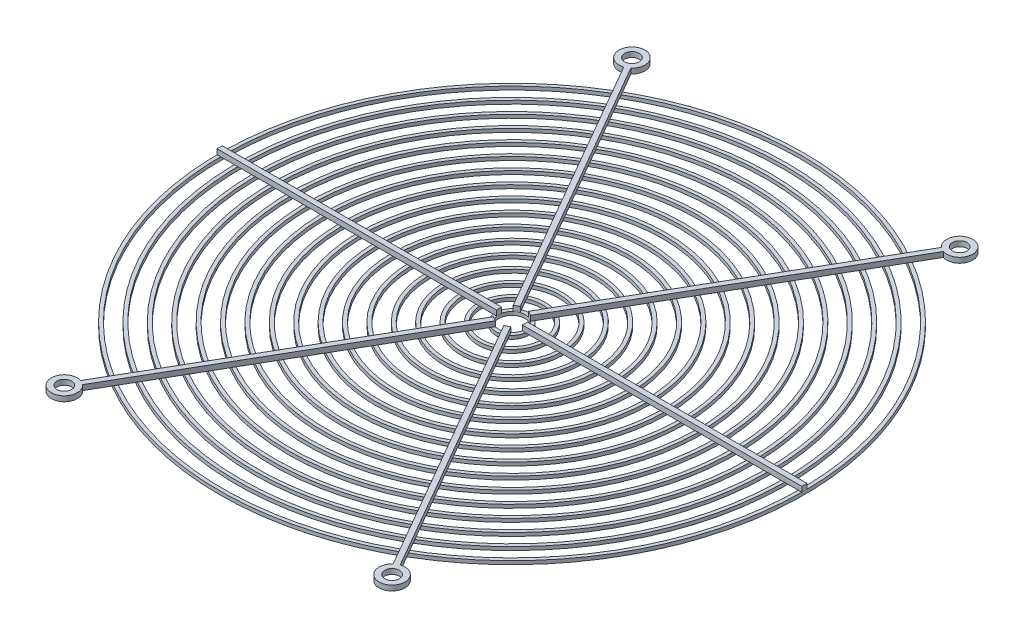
from build123d import *

# Parameters (mm, degrees)
ESQUISSE1_W                  = 2
ESQUISSE1_H                  = 2
ESQUISSE2_R                  = 4.25
EXTRUSION2_DEPTH             = 3
R_P_TITION_CIRCULAIRE2_COUNT = 6
ENL_V_START                  = -10
ENL_V_MAT_EXTRU_3_DEPTH      = 10


with BuildPart() as part:
    # Esquisse1 → R_volution1 (revolve)
    with BuildSketch(Plane.XY, mode=Mode.PRIVATE) as r_volution1_sk:
        with Locations((18.5, 1)):
            Rectangle(ESQUISSE1_W, ESQUISSE1_H)
        with Locations((8.5, 1)):
            Rectangle(ESQUISSE1_W, ESQUISSE1_H)
        with Locations((28.5, 1)):
            Rectangle(ESQUISSE1_W, ESQUISSE1_H)
        with Locations((38.5, 1)):
            Rectangle(ESQUISSE1_W, ESQUISSE1_H)
        with Locations((48.5, 1)):
            Rectangle(ESQUISSE1_W, ESQUISSE1_H)
        with Locations((58.5, 1)):
            Rectangle(ESQUISSE1_W, ESQUISSE1_H)
        with Locations((68.5, 1)):
            Rectangle(ESQUISSE1_W, ESQUISSE1_H)
        with Locations((78.5, 1)):
            Rectangle(ESQUISSE1_W, ESQUISSE1_H)
        with Locations((88.5, 1)):
            Rectangle(ESQUISSE1_W, ESQUISSE1_H)
        with Locations((98.5, 1)):
            Rectangle(ESQUISSE1_W, ESQUISSE1_H)
        with Locations((108.5, 1)):
            Rectangle(ESQUISSE1_W, ESQUISSE1_H)
        with Locations((118.5, 1)):
            Rectangle(ESQUISSE1_W, ESQUISSE1_H)
        with Locations((128.5, 1)):
            Rectangle(ESQUISSE1_W, ESQUISSE1_H)
        with Locations((138.5, 1)):
            Rectangle(ESQUISSE1_W, ESQUISSE1_H)
        with Locations((148.5, 1)):
            Rectangle(ESQUISSE1_W, ESQUISSE1_H)
        with Locations((158.5, 1)):
            Rectangle(ESQUISSE1_W, ESQUISSE1_H)
        with Locations((168.5, 1)):
            Rectangle(ESQUISSE1_W, ESQUISSE1_H)
    revolve(r_volution1_sk.sketch.rotate(Axis((0, 0, 0), (0, 1, 0)), 90), axis=Axis((0, 0, 0), (0, 1, 0)))


with BuildPart() as body_2:
    # Esquisse2 → Extrusion2 (new body)
    with BuildSketch(Plane(origin=(0, 2, 0), x_dir=(1, 0, 0), z_dir=(0, 1, 0))):
        with BuildLine():
            Line((7.5, 1.5), (182.651530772, 1.5))
            ThreePointArc((182.651530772, 1.5), (197.5, 0), (182.651530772, -1.5))
            Line((182.651530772, -1.5), (7.5, -1.5))
            Line((7.5, -1.5), (7.5, 1.5))
        make_face()
        with Locations(Location((190, 0, 0), (0, 0, 270))):
            Circle(ESQUISSE2_R, mode=Mode.SUBTRACT)
    extrude(amount=EXTRUSION2_DEPTH)


with BuildPart() as r_p_tition_circulaire2_1:
    # R_p_tition circulaire2: pattern copy
    add(body_2.part.rotate(Axis((0, 0, 0), (0, 1, 0)), 1 * 360 / R_P_TITION_CIRCULAIRE2_COUNT))


with BuildPart() as r_p_tition_circulaire2_2:
    # R_p_tition circulaire2: pattern copy
    add(body_2.part.rotate(Axis((0, 0, 0), (0, 1, 0)), 2 * 360 / R_P_TITION_CIRCULAIRE2_COUNT))


with BuildPart() as r_p_tition_circulaire2_3:
    # R_p_tition circulaire2: pattern copy
    add(body_2.part.rotate(Axis((0, 0, 0), (0, 1, 0)), 3 * 360 / R_P_TITION_CIRCULAIRE2_COUNT))


with BuildPart() as r_p_tition_circulaire2_4:
    # R_p_tition circulaire2: pattern copy
    add(body_2.part.rotate(Axis((0, 0, 0), (0, 1, 0)), 4 * 360 / R_P_TITION_CIRCULAIRE2_COUNT))


with BuildPart() as r_p_tition_circulaire2_5:
    # R_p_tition circulaire2: pattern copy
    add(body_2.part.rotate(Axis((0, 0, 0), (0, 1, 0)), 5 * 360 / R_P_TITION_CIRCULAIRE2_COUNT))


with BuildPart() as enl_v_mat_extru_3_tool:
    # Esquisse4 → Enl_v. mat.-Extru.3 (new body)
    with BuildSketch(Plane.XZ.offset(-2).offset(ENL_V_START)):
        with BuildLine():
            Line((169.5, 1.5), (169.5, -1.5))
            Line((169.5, -1.5), (182.651530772, -1.5))
            ThreePointArc((182.651530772, -1.5), (197.5, 0), (182.651530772, 1.5))
            Line((182.651530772, 1.5), (169.5, 1.5))
        make_face()
        with BuildLine():
            Line((-169.493362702, 1.5), (-182.651530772, 1.5))
            ThreePointArc((-182.651530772, 1.5), (-197.5, 0), (-182.651530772, -1.5))
            Line((-182.651530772, -1.5), (-169.493362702, -1.5))
            ThreePointArc((-169.493362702, -1.5), (-169.5, 0), (-169.493362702, 1.5))
        make_face()
    extrude(amount=ENL_V_MAT_EXTRU_3_DEPTH)


with BuildPart() as body_2_1:
    add(body_2.part)

    # Enl_v. mat.-Extru.3: cut by enl_v_mat_extru_3_tool
    add(enl_v_mat_extru_3_tool.part, mode=Mode.SUBTRACT)


with BuildPart() as r_p_tition_circulaire2_3_1:
    add(r_p_tition_circulaire2_3.part)

    # Enl_v. mat.-Extru.3: cut by enl_v_mat_extru_3_tool
    add(enl_v_mat_extru_3_tool.part, mode=Mode.SUBTRACT)


solid = Compound([part.part, r_p_tition_circulaire2_1.part, r_p_tition_circulaire2_2.part, r_p_tition_circulaire2_4.part, r_p_tition_circulaire2_5.part, body_2_1.part, r_p_tition_circulaire2_3_1.part])
